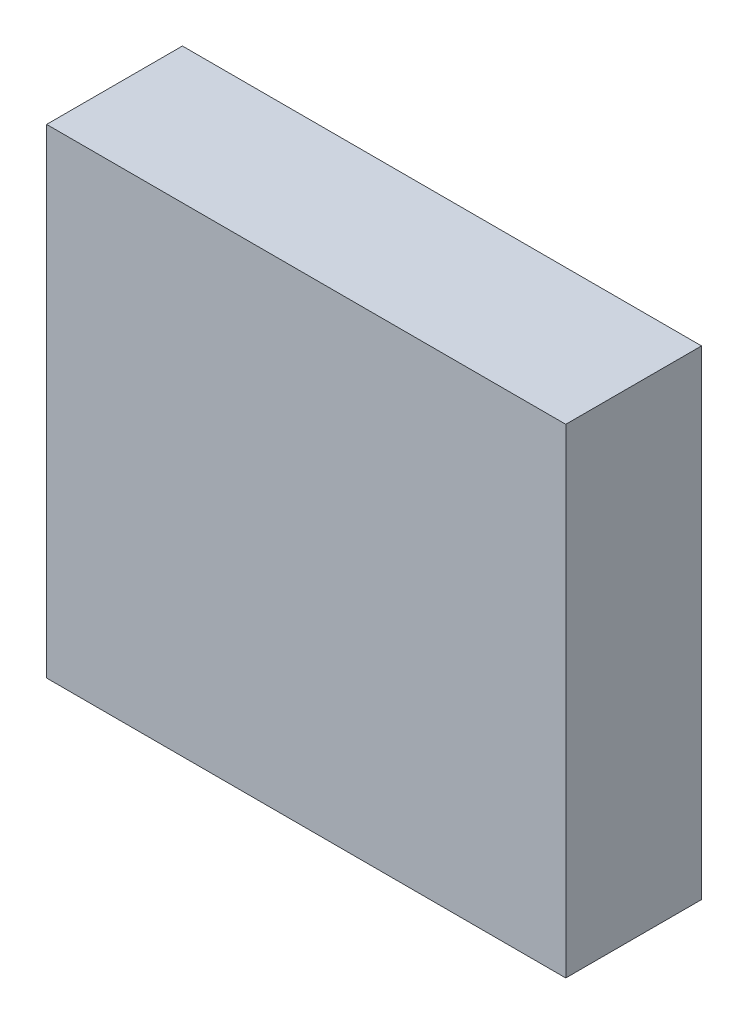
ISO-10303-21;
HEADER;
FILE_DESCRIPTION(('STEP AP214'),'2;1');
FILE_NAME('part.step','',(''),(''),'','','');
FILE_SCHEMA(('AUTOMOTIVE_DESIGN { 1 0 10303 214 1 1 1 1 }'));
ENDSEC;
DATA;
#1=APPLICATION_CONTEXT('core data for automotive mechanical design processes');
#2=APPLICATION_PROTOCOL_DEFINITION('international standard','automotive_design',2000,#1);
#3=PRODUCT_CONTEXT('',#1,'mechanical');
#4=PRODUCT('Part','Part','',(#3));
#5=PRODUCT_RELATED_PRODUCT_CATEGORY('part','',(#4));
#6=PRODUCT_DEFINITION_FORMATION('','',#4);
#7=PRODUCT_DEFINITION_CONTEXT('part definition',#1,'design');
#8=PRODUCT_DEFINITION('design','',#6,#7);
#9=PRODUCT_DEFINITION_SHAPE('','',#8);
#10=(LENGTH_UNIT() NAMED_UNIT(*) SI_UNIT(.MILLI.,.METRE.));
#11=(NAMED_UNIT(*) PLANE_ANGLE_UNIT() SI_UNIT($,.RADIAN.));
#12=(NAMED_UNIT(*) SI_UNIT($,.STERADIAN.) SOLID_ANGLE_UNIT());
#13=UNCERTAINTY_MEASURE_WITH_UNIT(LENGTH_MEASURE(1.E-05),#10,'distance_accuracy_value','');
#14=(GEOMETRIC_REPRESENTATION_CONTEXT(3) GLOBAL_UNCERTAINTY_ASSIGNED_CONTEXT((#13)) GLOBAL_UNIT_ASSIGNED_CONTEXT((#10,
#11,#12)) REPRESENTATION_CONTEXT('',''));
#15=CARTESIAN_POINT('',(0.,0.,0.));
#16=DIRECTION('',(0.,0.,1.));
#17=DIRECTION('',(1.,0.,0.));
#18=AXIS2_PLACEMENT_3D('',#15,#16,#17);
#19=CARTESIAN_POINT('',(8.2575019,-7.62750062,4.318));
#20=DIRECTION('',(0.,0.,1.));
#21=DIRECTION('',(1.,0.,0.));
#22=AXIS2_PLACEMENT_3D('',#19,#20,#21);
#23=PLANE('',#22);
#24=DIRECTION('',(-0.000328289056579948,-0.999999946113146,0.));
#25=VECTOR('',#24,1.);
#26=CARTESIAN_POINT('',(-8.25750444,-7.62229108,4.318));
#27=LINE('',#26,#25);
#28=CARTESIAN_POINT('',(-8.25750444,-7.62229108,4.318));
#29=VERTEX_POINT('',#28);
#30=CARTESIAN_POINT('',(-8.2524981,7.62750062,4.318));
#31=VERTEX_POINT('',#30);
#32=EDGE_CURVE('E53',#29,#31,#27,.F.);
#33=ORIENTED_EDGE('',*,*,#32,.F.);
#34=DIRECTION('',(0.999999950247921,-0.000315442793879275,0.));
#35=VECTOR('',#34,1.);
#36=CARTESIAN_POINT('',(8.2575019,-7.62750062,4.318));
#37=LINE('',#36,#35);
#38=CARTESIAN_POINT('',(8.2575019,-7.62750062,4.318));
#39=VERTEX_POINT('',#38);
#40=EDGE_CURVE('E68',#39,#29,#37,.F.);
#41=ORIENTED_EDGE('',*,*,#40,.F.);
#42=DIRECTION('',(1.66557404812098E-07,0.999999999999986,0.));
#43=VECTOR('',#42,1.);
#44=CARTESIAN_POINT('',(8.25750444,7.62249682,4.318));
#45=LINE('',#44,#43);
#46=CARTESIAN_POINT('',(8.25750317,7.62249682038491,4.318));
#47=VERTEX_POINT('',#46);
#48=EDGE_CURVE('E20',#47,#39,#45,.F.);
#49=ORIENTED_EDGE('',*,*,#48,.F.);
#50=DIRECTION('',(-0.999999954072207,0.000303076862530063,0.));
#51=VECTOR('',#50,1.);
#52=CARTESIAN_POINT('',(-8.2524981,7.62750062,4.318));
#53=LINE('',#52,#51);
#54=EDGE_CURVE('E58',#31,#47,#53,.F.);
#55=ORIENTED_EDGE('',*,*,#54,.F.);
#56=EDGE_LOOP('',(#33,#41,#49,#55));
#57=FACE_BOUND('',#56,.T.);
#58=ADVANCED_FACE('F17',(#57),#23,.T.);
#59=CARTESIAN_POINT('',(8.25750444,7.62249682,0.));
#60=DIRECTION('',(0.999999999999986,-1.66557404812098E-07,0.));
#61=DIRECTION('',(1.66557404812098E-07,0.999999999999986,0.));
#62=AXIS2_PLACEMENT_3D('',#59,#60,#61);
#63=PLANE('',#62);
#64=DIRECTION('',(0.,0.,1.));
#65=VECTOR('',#64,1.);
#66=CARTESIAN_POINT('',(8.2575019,-7.62750062,0.));
#67=LINE('',#66,#65);
#68=CARTESIAN_POINT('',(8.2575019,-7.62750062,0.));
#69=VERTEX_POINT('',#68);
#70=EDGE_CURVE('E79',#69,#39,#67,.T.);
#71=ORIENTED_EDGE('',*,*,#70,.F.);
#72=DIRECTION('',(0.,1.,0.));
#73=VECTOR('',#72,1.);
#74=CARTESIAN_POINT('',(8.2575019,-7.62750062,0.));
#75=LINE('',#74,#73);
#76=CARTESIAN_POINT('',(8.257503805,7.62249682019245,0.));
#77=VERTEX_POINT('',#76);
#78=EDGE_CURVE('E74',#69,#77,#75,.T.);
#79=ORIENTED_EDGE('',*,*,#78,.T.);
#80=DIRECTION('',(0.,0.,1.));
#81=VECTOR('',#80,1.);
#82=CARTESIAN_POINT('',(8.25750444,7.62249682,0.));
#83=LINE('',#82,#81);
#84=EDGE_CURVE('E63',#47,#77,#83,.F.);
#85=ORIENTED_EDGE('',*,*,#84,.F.);
#86=ORIENTED_EDGE('',*,*,#48,.T.);
#87=EDGE_LOOP('',(#71,#79,#85,#86));
#88=FACE_BOUND('',#87,.T.);
#89=ADVANCED_FACE('F73',(#88),#63,.T.);
#90=CARTESIAN_POINT('',(-8.2524981,7.62750062,0.));
#91=DIRECTION('',(0.000303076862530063,0.999999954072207,0.));
#92=DIRECTION('',(-0.999999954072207,0.000303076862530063,0.));
#93=AXIS2_PLACEMENT_3D('',#90,#91,#92);
#94=PLANE('',#93);
#95=ORIENTED_EDGE('',*,*,#84,.T.);
#96=DIRECTION('',(-0.999999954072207,0.000303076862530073,0.));
#97=VECTOR('',#96,1.);
#98=CARTESIAN_POINT('',(8.25750444,7.62249682,0.));
#99=LINE('',#98,#97);
#100=CARTESIAN_POINT('',(-8.2524981,7.62750062,0.));
#101=VERTEX_POINT('',#100);
#102=EDGE_CURVE('E84',#77,#101,#99,.T.);
#103=ORIENTED_EDGE('',*,*,#102,.T.);
#104=DIRECTION('',(0.,0.,1.));
#105=VECTOR('',#104,1.);
#106=CARTESIAN_POINT('',(-8.25249809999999,7.62750062,0.));
#107=LINE('',#106,#105);
#108=EDGE_CURVE('E65',#31,#101,#107,.F.);
#109=ORIENTED_EDGE('',*,*,#108,.F.);
#110=ORIENTED_EDGE('',*,*,#54,.T.);
#111=EDGE_LOOP('',(#95,#103,#109,#110));
#112=FACE_BOUND('',#111,.T.);
#113=ADVANCED_FACE('F60',(#112),#94,.T.);
#114=CARTESIAN_POINT('',(-8.25750444,-7.62229108,0.));
#115=DIRECTION('',(-0.999999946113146,0.000328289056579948,0.));
#116=DIRECTION('',(-0.000328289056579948,-0.999999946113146,0.));
#117=AXIS2_PLACEMENT_3D('',#114,#115,#116);
#118=PLANE('',#117);
#119=ORIENTED_EDGE('',*,*,#108,.T.);
#120=DIRECTION('',(-0.000328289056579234,-0.999999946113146,0.));
#121=VECTOR('',#120,1.);
#122=CARTESIAN_POINT('',(-8.2524981,7.62750062,0.));
#123=LINE('',#122,#121);
#124=CARTESIAN_POINT('',(-8.25750444,-7.62229108,0.));
#125=VERTEX_POINT('',#124);
#126=EDGE_CURVE('E26',#101,#125,#123,.T.);
#127=ORIENTED_EDGE('',*,*,#126,.T.);
#128=DIRECTION('',(0.,0.,1.));
#129=VECTOR('',#128,1.);
#130=CARTESIAN_POINT('',(-8.25750443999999,-7.62229107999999,0.));
#131=LINE('',#130,#129);
#132=EDGE_CURVE('E34',#29,#125,#131,.F.);
#133=ORIENTED_EDGE('',*,*,#132,.F.);
#134=ORIENTED_EDGE('',*,*,#32,.T.);
#135=EDGE_LOOP('',(#119,#127,#133,#134));
#136=FACE_BOUND('',#135,.T.);
#137=ADVANCED_FACE('F88',(#136),#118,.T.);
#138=CARTESIAN_POINT('',(8.2575019,-7.62750062,0.));
#139=DIRECTION('',(-0.000315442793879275,-0.999999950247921,0.));
#140=DIRECTION('',(0.999999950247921,-0.000315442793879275,0.));
#141=AXIS2_PLACEMENT_3D('',#138,#139,#140);
#142=PLANE('',#141);
#143=ORIENTED_EDGE('',*,*,#132,.T.);
#144=DIRECTION('',(0.999999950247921,-0.000315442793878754,0.));
#145=VECTOR('',#144,1.);
#146=CARTESIAN_POINT('',(-8.25750444,-7.62229108,0.));
#147=LINE('',#146,#145);
#148=EDGE_CURVE('E11',#125,#69,#147,.T.);
#149=ORIENTED_EDGE('',*,*,#148,.T.);
#150=ORIENTED_EDGE('',*,*,#70,.T.);
#151=ORIENTED_EDGE('',*,*,#40,.T.);
#152=EDGE_LOOP('',(#143,#149,#150,#151));
#153=FACE_BOUND('',#152,.T.);
#154=ADVANCED_FACE('F91',(#153),#142,.T.);
#155=CARTESIAN_POINT('',(8.2575019,-7.62750062,0.));
#156=DIRECTION('',(0.,0.,1.));
#157=DIRECTION('',(1.,0.,0.));
#158=AXIS2_PLACEMENT_3D('',#155,#156,#157);
#159=PLANE('',#158);
#160=ORIENTED_EDGE('',*,*,#126,.F.);
#161=ORIENTED_EDGE('',*,*,#102,.F.);
#162=ORIENTED_EDGE('',*,*,#78,.F.);
#163=ORIENTED_EDGE('',*,*,#148,.F.);
#164=EDGE_LOOP('',(#160,#161,#162,#163));
#165=FACE_BOUND('',#164,.T.);
#166=ADVANCED_FACE('F90',(#165),#159,.F.);
#167=CLOSED_SHELL('',(#58,#89,#113,#137,#154,#166));
#168=MANIFOLD_SOLID_BREP('B1',#167);
#169=ADVANCED_BREP_SHAPE_REPRESENTATION('',(#18,#168),#14);
#170=SHAPE_DEFINITION_REPRESENTATION(#9,#169);
ENDSEC;
END-ISO-10303-21;
